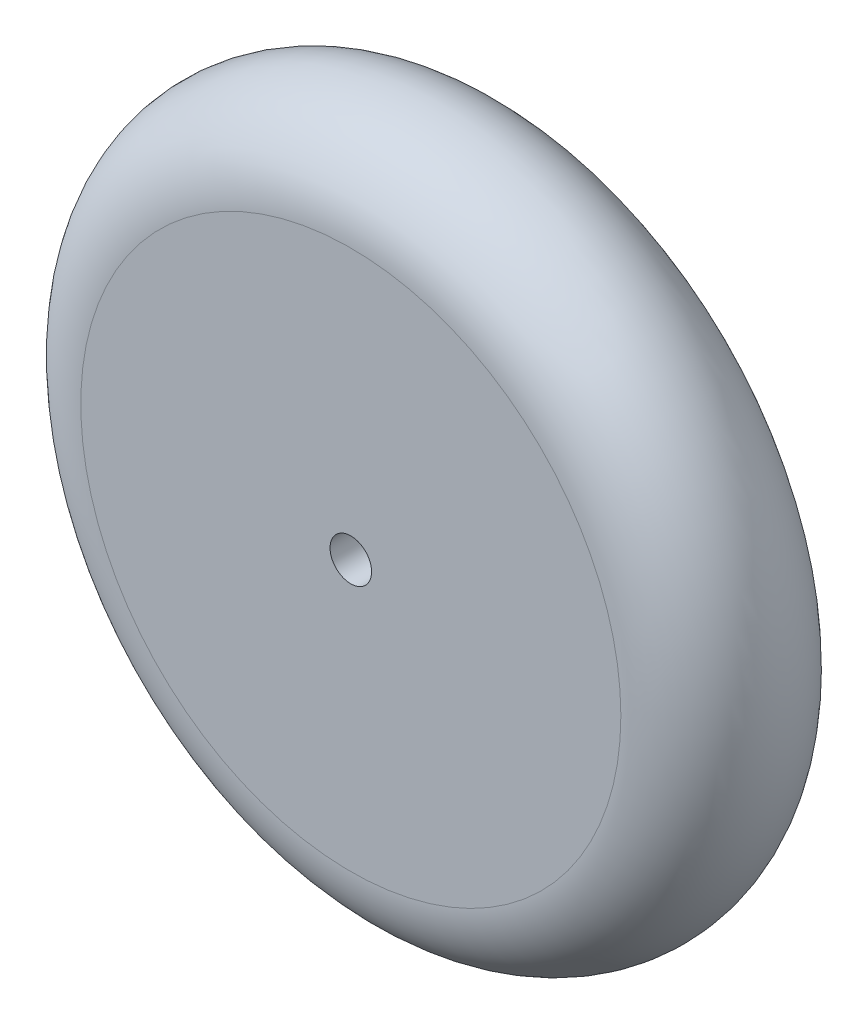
from build123d import *


with BuildPart() as part:
    # Esquisse1 → R_volution1 (revolve)
    with BuildSketch(Plane(origin=(0, 0, 0), x_dir=(1, 0, 0), z_dir=(0, 1, 0))):
        with BuildLine():
            Line((5, -20), (5, 20))
            Line((5, 20), (65, 20))
            ThreePointArc((65, 20), (85, 0), (65, -20))
            Line((65, -20), (5, -20))
        make_face()
    revolve(axis=Axis((0, 0, 19.909560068), (0, 0, -1)))


solid = part.part
